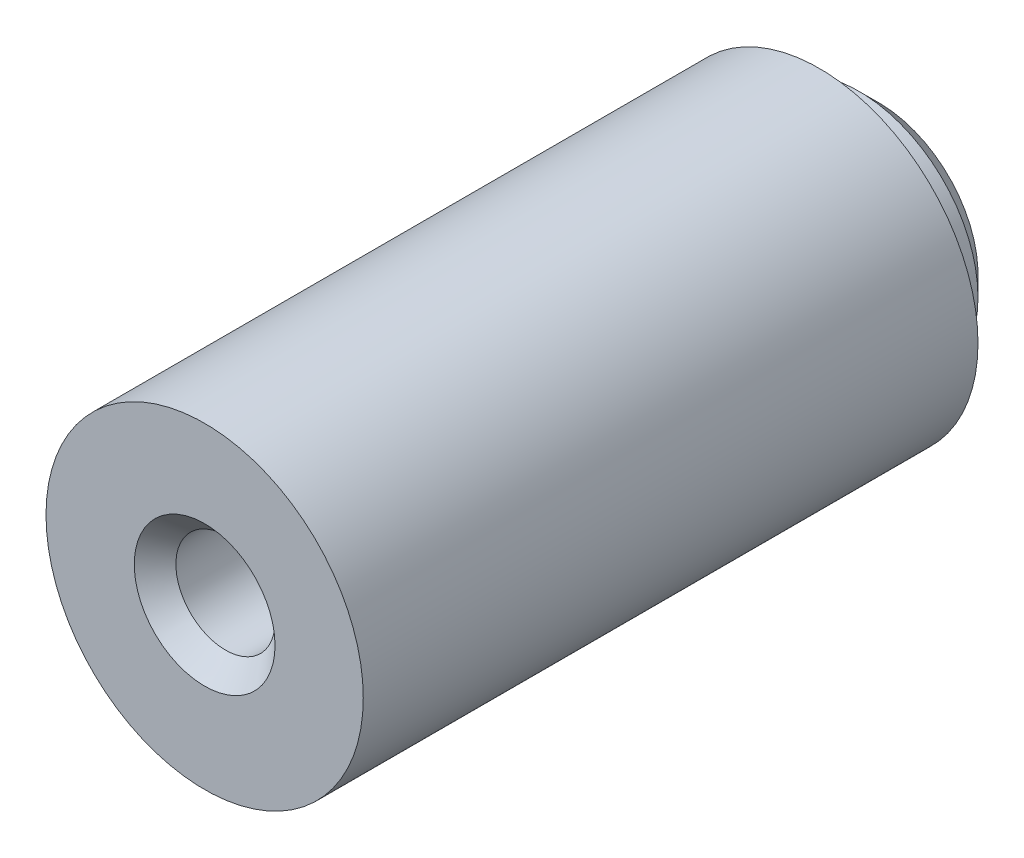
from build123d import *

# Parameters (mm, degrees)
SKICA1_R                = 4
P_IDAT_VYSUNUT_M1_DEPTH = 15.5
M3_Z_VIT1_D             = 2.5
M3_Z_VIT1_DEPTH         = 12.5
M3_Z_VIT1_CSINK_D       = 3.55
M3_Z_VIT1_CSINK_ANGLE   = 90
M3_Z_VIT1_TIP           = 0.751075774
SKICA4_R                = 3
P_IDAT_VYSUNUT_M2_DEPTH = 1.5
ZKOSEN_1_SIZE           = 0.5


with BuildPart() as part:
    # Skica1 → P_idat vysunut_m1 (new body)
    with BuildSketch(Plane.XY):
        Circle(SKICA1_R)
    extrude(amount=P_IDAT_VYSUNUT_M1_DEPTH)

    # M3 z_vit1
    with Locations(Plane(origin=(0.000299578, 0.03461532, 15.5), x_dir=(1, 0, 0), z_dir=(0, 0, 1))):
        with Locations((0, 0)):
            CounterSinkHole(M3_Z_VIT1_D / 2, M3_Z_VIT1_CSINK_D / 2, depth=M3_Z_VIT1_DEPTH, counter_sink_angle=M3_Z_VIT1_CSINK_ANGLE)
            with Locations((0, 0, -(M3_Z_VIT1_DEPTH + M3_Z_VIT1_TIP / 2))):  # 118° drill point
                Cone(0, M3_Z_VIT1_D / 2, M3_Z_VIT1_TIP, mode=Mode.SUBTRACT)

    # Skica4 → P_idat vysunut_m2 (add)
    with BuildSketch(Plane(origin=(0, 0, 0), x_dir=(-1, 0, 0), z_dir=(0, 0, -1))):
        with Locations(Location((0, 0, 0), (0, 0, 180))):
            Circle(SKICA4_R)
    extrude(amount=P_IDAT_VYSUNUT_M2_DEPTH)

    # Zkosen_1
    zkosen_1_edges = [part.edges().sort_by_distance(p)[0] for p in [
        (-3, 0, -1.5),
    ]]
    chamfer(zkosen_1_edges, length=ZKOSEN_1_SIZE)


solid = part.part
